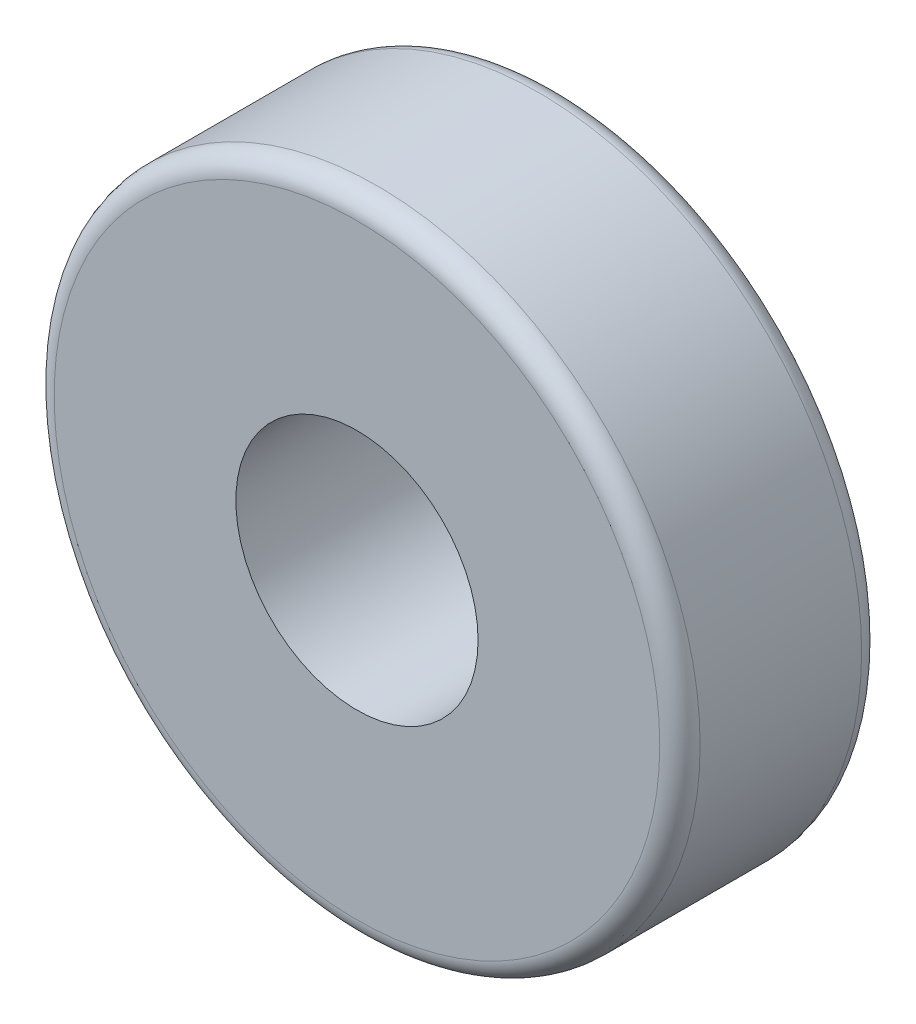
ISO-10303-21;
HEADER;
FILE_DESCRIPTION(('STEP AP214'),'2;1');
FILE_NAME('part.step','',(''),(''),'','','');
FILE_SCHEMA(('AUTOMOTIVE_DESIGN { 1 0 10303 214 1 1 1 1 }'));
ENDSEC;
DATA;
#1=APPLICATION_CONTEXT('core data for automotive mechanical design processes');
#2=APPLICATION_PROTOCOL_DEFINITION('international standard','automotive_design',2000,#1);
#3=PRODUCT_CONTEXT('',#1,'mechanical');
#4=PRODUCT('Part','Part','',(#3));
#5=PRODUCT_RELATED_PRODUCT_CATEGORY('part','',(#4));
#6=PRODUCT_DEFINITION_FORMATION('','',#4);
#7=PRODUCT_DEFINITION_CONTEXT('part definition',#1,'design');
#8=PRODUCT_DEFINITION('design','',#6,#7);
#9=PRODUCT_DEFINITION_SHAPE('','',#8);
#10=(LENGTH_UNIT() NAMED_UNIT(*) SI_UNIT(.MILLI.,.METRE.));
#11=(NAMED_UNIT(*) PLANE_ANGLE_UNIT() SI_UNIT($,.RADIAN.));
#12=(NAMED_UNIT(*) SI_UNIT($,.STERADIAN.) SOLID_ANGLE_UNIT());
#13=UNCERTAINTY_MEASURE_WITH_UNIT(LENGTH_MEASURE(1.E-05),#10,'distance_accuracy_value','');
#14=(GEOMETRIC_REPRESENTATION_CONTEXT(3) GLOBAL_UNCERTAINTY_ASSIGNED_CONTEXT((#13)) GLOBAL_UNIT_ASSIGNED_CONTEXT((#10,
#11,#12)) REPRESENTATION_CONTEXT('',''));
#15=CARTESIAN_POINT('',(0.,0.,0.));
#16=DIRECTION('',(0.,0.,1.));
#17=DIRECTION('',(1.,0.,0.));
#18=AXIS2_PLACEMENT_3D('',#15,#16,#17);
#19=CARTESIAN_POINT('',(0.,0.,10.));
#20=DIRECTION('',(0.,0.,1.));
#21=DIRECTION('',(1.,0.,0.));
#22=AXIS2_PLACEMENT_3D('',#19,#20,#21);
#23=PLANE('',#22);
#24=CARTESIAN_POINT('',(0.,0.,10.));
#25=DIRECTION('',(0.,0.,1.));
#26=DIRECTION('',(1.,0.,0.));
#27=AXIS2_PLACEMENT_3D('',#24,#25,#26);
#28=CIRCLE('',#27,15.);
#29=CARTESIAN_POINT('',(15.,0.,10.));
#30=VERTEX_POINT('',#29);
#31=EDGE_CURVE('E54',#30,#30,#28,.T.);
#32=ORIENTED_EDGE('',*,*,#31,.T.);
#33=EDGE_LOOP('',(#32));
#34=FACE_BOUND('',#33,.T.);
#35=CARTESIAN_POINT('',(0.,0.,10.));
#36=DIRECTION('',(0.,0.,1.));
#37=DIRECTION('',(1.,0.,0.));
#38=AXIS2_PLACEMENT_3D('',#35,#36,#37);
#39=CIRCLE('',#38,6.);
#40=CARTESIAN_POINT('',(6.,0.,10.));
#41=VERTEX_POINT('',#40);
#42=EDGE_CURVE('E57',#41,#41,#39,.T.);
#43=ORIENTED_EDGE('',*,*,#42,.F.);
#44=EDGE_LOOP('',(#43));
#45=FACE_BOUND('',#44,.T.);
#46=ADVANCED_FACE('F31',(#34,#45),#23,.T.);
#47=CARTESIAN_POINT('',(0.,0.,0.));
#48=DIRECTION('',(0.,0.,1.));
#49=DIRECTION('',(1.,0.,0.));
#50=AXIS2_PLACEMENT_3D('',#47,#48,#49);
#51=PLANE('',#50);
#52=CARTESIAN_POINT('',(0.,0.,0.));
#53=DIRECTION('',(0.,0.,1.));
#54=DIRECTION('',(1.,0.,0.));
#55=AXIS2_PLACEMENT_3D('',#52,#53,#54);
#56=CIRCLE('',#55,7.);
#57=CARTESIAN_POINT('',(7.,0.,0.));
#58=VERTEX_POINT('',#57);
#59=EDGE_CURVE('E38',#58,#58,#56,.T.);
#60=ORIENTED_EDGE('',*,*,#59,.T.);
#61=EDGE_LOOP('',(#60));
#62=FACE_BOUND('',#61,.T.);
#63=CARTESIAN_POINT('',(0.,0.,0.));
#64=DIRECTION('',(0.,0.,1.));
#65=DIRECTION('',(1.,0.,0.));
#66=AXIS2_PLACEMENT_3D('',#63,#64,#65);
#67=CIRCLE('',#66,15.);
#68=CARTESIAN_POINT('',(15.,0.,0.));
#69=VERTEX_POINT('',#68);
#70=EDGE_CURVE('E42',#69,#69,#67,.F.);
#71=ORIENTED_EDGE('',*,*,#70,.T.);
#72=EDGE_LOOP('',(#71));
#73=FACE_BOUND('',#72,.T.);
#74=ADVANCED_FACE('F64',(#62,#73),#51,.F.);
#75=CARTESIAN_POINT('',(0.,0.,10.));
#76=DIRECTION('',(0.,0.,-1.));
#77=DIRECTION('',(-1.,0.,0.));
#78=AXIS2_PLACEMENT_3D('',#75,#76,#77);
#79=CYLINDRICAL_SURFACE('',#78,16.);
#80=CARTESIAN_POINT('',(0.,0.,9.));
#81=DIRECTION('',(0.,0.,1.));
#82=DIRECTION('',(1.,0.,0.));
#83=AXIS2_PLACEMENT_3D('',#80,#81,#82);
#84=CIRCLE('',#83,16.);
#85=CARTESIAN_POINT('',(16.,0.,9.));
#86=VERTEX_POINT('',#85);
#87=EDGE_CURVE('E46',#86,#86,#84,.F.);
#88=ORIENTED_EDGE('',*,*,#87,.T.);
#89=EDGE_LOOP('',(#88));
#90=FACE_BOUND('',#89,.T.);
#91=CARTESIAN_POINT('',(0.,0.,0.999999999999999));
#92=DIRECTION('',(0.,0.,1.));
#93=DIRECTION('',(1.,0.,0.));
#94=AXIS2_PLACEMENT_3D('',#91,#92,#93);
#95=CIRCLE('',#94,16.);
#96=CARTESIAN_POINT('',(16.,0.,0.999999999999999));
#97=VERTEX_POINT('',#96);
#98=EDGE_CURVE('E51',#97,#97,#95,.T.);
#99=ORIENTED_EDGE('',*,*,#98,.T.);
#100=EDGE_LOOP('',(#99));
#101=FACE_BOUND('',#100,.T.);
#102=ADVANCED_FACE('F70',(#90,#101),#79,.T.);
#103=CARTESIAN_POINT('',(0.,0.,10.));
#104=DIRECTION('',(0.,0.,-1.));
#105=DIRECTION('',(-1.,0.,0.));
#106=AXIS2_PLACEMENT_3D('',#103,#104,#105);
#107=CYLINDRICAL_SURFACE('',#106,6.);
#108=CARTESIAN_POINT('',(0.,0.,0.999999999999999));
#109=DIRECTION('',(0.,0.,1.));
#110=DIRECTION('',(1.,0.,0.));
#111=AXIS2_PLACEMENT_3D('',#108,#109,#110);
#112=CIRCLE('',#111,6.);
#113=CARTESIAN_POINT('',(6.,0.,0.999999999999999));
#114=VERTEX_POINT('',#113);
#115=EDGE_CURVE('E10',#114,#114,#112,.F.);
#116=ORIENTED_EDGE('',*,*,#115,.T.);
#117=EDGE_LOOP('',(#116));
#118=FACE_BOUND('',#117,.T.);
#119=ORIENTED_EDGE('',*,*,#42,.T.);
#120=EDGE_LOOP('',(#119));
#121=FACE_BOUND('',#120,.T.);
#122=ADVANCED_FACE('F61',(#118,#121),#107,.F.);
#123=CARTESIAN_POINT('',(0.,0.,9.));
#124=DIRECTION('',(0.,0.,1.));
#125=DIRECTION('',(1.,0.,0.));
#126=AXIS2_PLACEMENT_3D('',#123,#124,#125);
#127=TOROIDAL_SURFACE('',#126,15.,1.);
#128=ORIENTED_EDGE('',*,*,#87,.F.);
#129=EDGE_LOOP('',(#128));
#130=FACE_BOUND('',#129,.T.);
#131=ORIENTED_EDGE('',*,*,#31,.F.);
#132=EDGE_LOOP('',(#131));
#133=FACE_BOUND('',#132,.T.);
#134=ADVANCED_FACE('F77',(#130,#133),#127,.T.);
#135=CARTESIAN_POINT('',(0.,0.,0.999999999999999));
#136=DIRECTION('',(0.,0.,1.));
#137=DIRECTION('',(1.,0.,0.));
#138=AXIS2_PLACEMENT_3D('',#135,#136,#137);
#139=TOROIDAL_SURFACE('',#138,7.,1.);
#140=ORIENTED_EDGE('',*,*,#115,.F.);
#141=EDGE_LOOP('',(#140));
#142=FACE_BOUND('',#141,.T.);
#143=ORIENTED_EDGE('',*,*,#59,.F.);
#144=EDGE_LOOP('',(#143));
#145=FACE_BOUND('',#144,.T.);
#146=ADVANCED_FACE('F79',(#142,#145),#139,.T.);
#147=CARTESIAN_POINT('',(0.,0.,0.999999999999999));
#148=DIRECTION('',(0.,0.,1.));
#149=DIRECTION('',(1.,0.,0.));
#150=AXIS2_PLACEMENT_3D('',#147,#148,#149);
#151=TOROIDAL_SURFACE('',#150,15.,1.);
#152=ORIENTED_EDGE('',*,*,#70,.F.);
#153=EDGE_LOOP('',(#152));
#154=FACE_BOUND('',#153,.T.);
#155=ORIENTED_EDGE('',*,*,#98,.F.);
#156=EDGE_LOOP('',(#155));
#157=FACE_BOUND('',#156,.T.);
#158=ADVANCED_FACE('F33',(#154,#157),#151,.T.);
#159=CLOSED_SHELL('',(#46,#74,#102,#122,#134,#146,#158));
#160=MANIFOLD_SOLID_BREP('B2',#159);
#161=ADVANCED_BREP_SHAPE_REPRESENTATION('',(#18,#160),#14);
#162=SHAPE_DEFINITION_REPRESENTATION(#9,#161);
ENDSEC;
END-ISO-10303-21;
